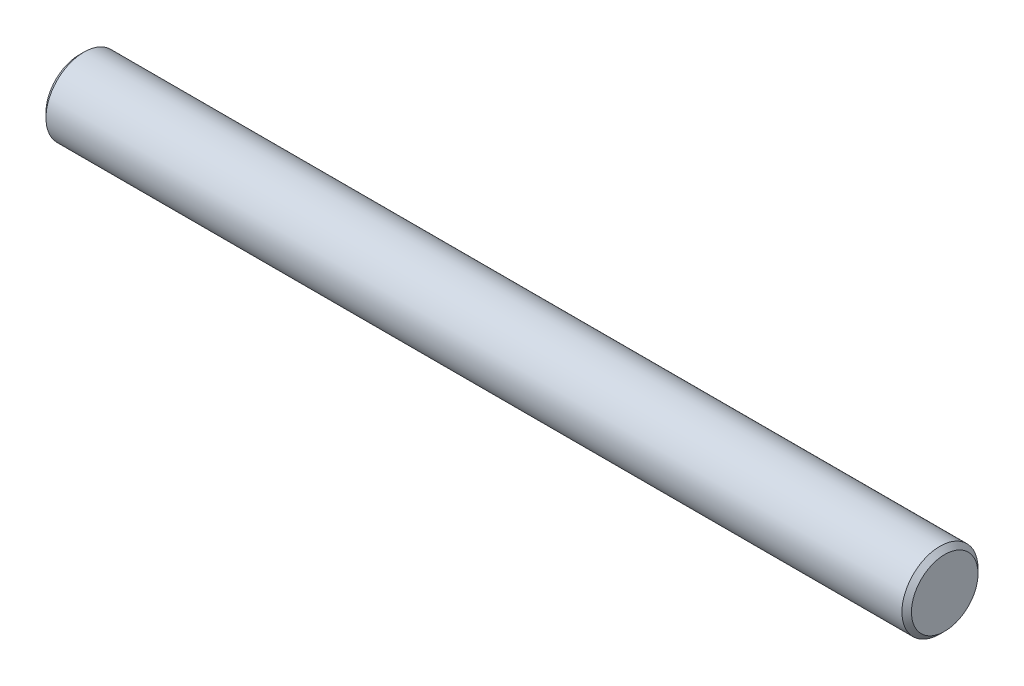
ISO-10303-21;
HEADER;
FILE_DESCRIPTION(('STEP AP214'),'2;1');
FILE_NAME('part.step','',(''),(''),'','','');
FILE_SCHEMA(('AUTOMOTIVE_DESIGN { 1 0 10303 214 1 1 1 1 }'));
ENDSEC;
DATA;
#1=APPLICATION_CONTEXT('core data for automotive mechanical design processes');
#2=APPLICATION_PROTOCOL_DEFINITION('international standard','automotive_design',2000,#1);
#3=PRODUCT_CONTEXT('',#1,'mechanical');
#4=PRODUCT('Part','Part','',(#3));
#5=PRODUCT_RELATED_PRODUCT_CATEGORY('part','',(#4));
#6=PRODUCT_DEFINITION_FORMATION('','',#4);
#7=PRODUCT_DEFINITION_CONTEXT('part definition',#1,'design');
#8=PRODUCT_DEFINITION('design','',#6,#7);
#9=PRODUCT_DEFINITION_SHAPE('','',#8);
#10=(LENGTH_UNIT() NAMED_UNIT(*) SI_UNIT(.MILLI.,.METRE.));
#11=(NAMED_UNIT(*) PLANE_ANGLE_UNIT() SI_UNIT($,.RADIAN.));
#12=(NAMED_UNIT(*) SI_UNIT($,.STERADIAN.) SOLID_ANGLE_UNIT());
#13=UNCERTAINTY_MEASURE_WITH_UNIT(LENGTH_MEASURE(1.E-05),#10,'distance_accuracy_value','');
#14=(GEOMETRIC_REPRESENTATION_CONTEXT(3) GLOBAL_UNCERTAINTY_ASSIGNED_CONTEXT((#13)) GLOBAL_UNIT_ASSIGNED_CONTEXT((#10,
#11,#12)) REPRESENTATION_CONTEXT('',''));
#15=CARTESIAN_POINT('',(0.,0.,0.));
#16=DIRECTION('',(0.,0.,1.));
#17=DIRECTION('',(1.,0.,0.));
#18=AXIS2_PLACEMENT_3D('',#15,#16,#17);
#19=CARTESIAN_POINT('',(182.,0.,0.));
#20=DIRECTION('',(-1.,0.,0.));
#21=DIRECTION('',(0.,0.,1.));
#22=AXIS2_PLACEMENT_3D('',#19,#20,#21);
#23=CYLINDRICAL_SURFACE('',#22,8.);
#24=CARTESIAN_POINT('',(181.,0.,0.));
#25=DIRECTION('',(1.,0.,0.));
#26=DIRECTION('',(0.,0.,-1.));
#27=AXIS2_PLACEMENT_3D('',#24,#25,#26);
#28=CIRCLE('',#27,8.);
#29=CARTESIAN_POINT('',(181.,0.,-8.));
#30=VERTEX_POINT('',#29);
#31=EDGE_CURVE('E9178',#30,#30,#28,.F.);
#32=ORIENTED_EDGE('',*,*,#31,.T.);
#33=EDGE_LOOP('',(#32));
#34=FACE_BOUND('',#33,.T.);
#35=CARTESIAN_POINT('',(1.,0.,0.));
#36=DIRECTION('',(1.,0.,0.));
#37=DIRECTION('',(0.,0.,-1.));
#38=AXIS2_PLACEMENT_3D('',#35,#36,#37);
#39=CIRCLE('',#38,8.);
#40=CARTESIAN_POINT('',(1.,0.,-8.));
#41=VERTEX_POINT('',#40);
#42=EDGE_CURVE('E9182',#41,#41,#39,.T.);
#43=ORIENTED_EDGE('',*,*,#42,.T.);
#44=EDGE_LOOP('',(#43));
#45=FACE_BOUND('',#44,.T.);
#46=ADVANCED_FACE('F9172',(#34,#45),#23,.T.);
#47=CARTESIAN_POINT('',(182.,0.,0.));
#48=DIRECTION('',(1.,0.,0.));
#49=DIRECTION('',(0.,0.,-1.));
#50=AXIS2_PLACEMENT_3D('',#47,#48,#49);
#51=PLANE('',#50);
#52=CARTESIAN_POINT('',(182.,0.,0.));
#53=DIRECTION('',(1.,0.,0.));
#54=DIRECTION('',(0.,0.,-1.));
#55=AXIS2_PLACEMENT_3D('',#52,#53,#54);
#56=CIRCLE('',#55,7.);
#57=CARTESIAN_POINT('',(182.,0.,-7.));
#58=VERTEX_POINT('',#57);
#59=EDGE_CURVE('E9186',#58,#58,#56,.T.);
#60=ORIENTED_EDGE('',*,*,#59,.T.);
#61=EDGE_LOOP('',(#60));
#62=FACE_BOUND('',#61,.T.);
#63=ADVANCED_FACE('F9192',(#62),#51,.T.);
#64=CARTESIAN_POINT('',(0.,0.,0.));
#65=DIRECTION('',(1.,0.,0.));
#66=DIRECTION('',(0.,0.,-1.));
#67=AXIS2_PLACEMENT_3D('',#64,#65,#66);
#68=PLANE('',#67);
#69=CARTESIAN_POINT('',(0.,0.,0.));
#70=DIRECTION('',(1.,0.,0.));
#71=DIRECTION('',(0.,0.,-1.));
#72=AXIS2_PLACEMENT_3D('',#69,#70,#71);
#73=CIRCLE('',#72,7.);
#74=CARTESIAN_POINT('',(0.,0.,-7.));
#75=VERTEX_POINT('',#74);
#76=EDGE_CURVE('E10',#75,#75,#73,.F.);
#77=ORIENTED_EDGE('',*,*,#76,.T.);
#78=EDGE_LOOP('',(#77));
#79=FACE_BOUND('',#78,.T.);
#80=ADVANCED_FACE('F9197',(#79),#68,.F.);
#81=CARTESIAN_POINT('',(182.,0.,0.));
#82=DIRECTION('',(-1.,0.,0.));
#83=DIRECTION('',(0.,0.,1.));
#84=AXIS2_PLACEMENT_3D('',#81,#82,#83);
#85=CONICAL_SURFACE('',#84,7.,0.785398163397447);
#86=ORIENTED_EDGE('',*,*,#31,.F.);
#87=EDGE_LOOP('',(#86));
#88=FACE_BOUND('',#87,.T.);
#89=ORIENTED_EDGE('',*,*,#59,.F.);
#90=EDGE_LOOP('',(#89));
#91=FACE_BOUND('',#90,.T.);
#92=ADVANCED_FACE('F9194',(#88,#91),#85,.T.);
#93=CARTESIAN_POINT('',(1.,0.,0.));
#94=DIRECTION('',(1.,0.,0.));
#95=DIRECTION('',(0.,0.,-1.));
#96=AXIS2_PLACEMENT_3D('',#93,#94,#95);
#97=CONICAL_SURFACE('',#96,8.,0.785398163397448);
#98=ORIENTED_EDGE('',*,*,#76,.F.);
#99=EDGE_LOOP('',(#98));
#100=FACE_BOUND('',#99,.T.);
#101=ORIENTED_EDGE('',*,*,#42,.F.);
#102=EDGE_LOOP('',(#101));
#103=FACE_BOUND('',#102,.T.);
#104=ADVANCED_FACE('F9196',(#100,#103),#97,.T.);
#105=CLOSED_SHELL('',(#46,#63,#80,#92,#104));
#106=MANIFOLD_SOLID_BREP('B2',#105);
#107=ADVANCED_BREP_SHAPE_REPRESENTATION('',(#18,#106),#14);
#108=SHAPE_DEFINITION_REPRESENTATION(#9,#107);
ENDSEC;
END-ISO-10303-21;
